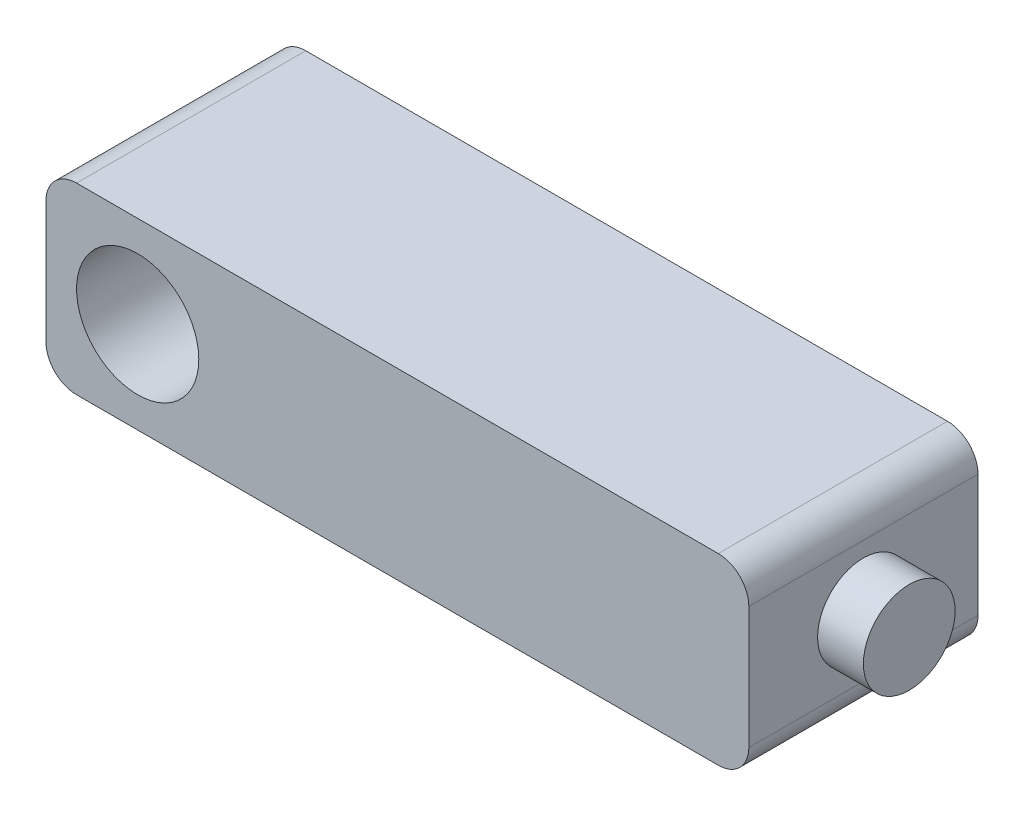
ISO-10303-21;
HEADER;
FILE_DESCRIPTION(('STEP AP214'),'2;1');
FILE_NAME('part.step','',(''),(''),'','','');
FILE_SCHEMA(('AUTOMOTIVE_DESIGN { 1 0 10303 214 1 1 1 1 }'));
ENDSEC;
DATA;
#1=APPLICATION_CONTEXT('core data for automotive mechanical design processes');
#2=APPLICATION_PROTOCOL_DEFINITION('international standard','automotive_design',2000,#1);
#3=PRODUCT_CONTEXT('',#1,'mechanical');
#4=PRODUCT('Part','Part','',(#3));
#5=PRODUCT_RELATED_PRODUCT_CATEGORY('part','',(#4));
#6=PRODUCT_DEFINITION_FORMATION('','',#4);
#7=PRODUCT_DEFINITION_CONTEXT('part definition',#1,'design');
#8=PRODUCT_DEFINITION('design','',#6,#7);
#9=PRODUCT_DEFINITION_SHAPE('','',#8);
#10=(LENGTH_UNIT() NAMED_UNIT(*) SI_UNIT(.MILLI.,.METRE.));
#11=(NAMED_UNIT(*) PLANE_ANGLE_UNIT() SI_UNIT($,.RADIAN.));
#12=(NAMED_UNIT(*) SI_UNIT($,.STERADIAN.) SOLID_ANGLE_UNIT());
#13=UNCERTAINTY_MEASURE_WITH_UNIT(LENGTH_MEASURE(1.E-05),#10,'distance_accuracy_value','');
#14=(GEOMETRIC_REPRESENTATION_CONTEXT(3) GLOBAL_UNCERTAINTY_ASSIGNED_CONTEXT((#13)) GLOBAL_UNIT_ASSIGNED_CONTEXT((#10,
#11,#12)) REPRESENTATION_CONTEXT('',''));
#15=CARTESIAN_POINT('',(0.,0.,0.));
#16=DIRECTION('',(0.,0.,1.));
#17=DIRECTION('',(1.,0.,0.));
#18=AXIS2_PLACEMENT_3D('',#15,#16,#17);
#19=CARTESIAN_POINT('',(460.,0.,150.));
#20=DIRECTION('',(-1.,0.,0.));
#21=DIRECTION('',(0.,0.,1.));
#22=AXIS2_PLACEMENT_3D('',#19,#20,#21);
#23=PLANE('',#22);
#24=DIRECTION('',(0.,1.,0.));
#25=VECTOR('',#24,1.);
#26=CARTESIAN_POINT('',(460.,0.,150.));
#27=LINE('',#26,#25);
#28=CARTESIAN_POINT('',(460.,20.,150.));
#29=VERTEX_POINT('',#28);
#30=CARTESIAN_POINT('',(460.,100.,150.));
#31=VERTEX_POINT('',#30);
#32=EDGE_CURVE('E164',#29,#31,#27,.T.);
#33=ORIENTED_EDGE('',*,*,#32,.F.);
#34=DIRECTION('',(0.,0.,-1.));
#35=VECTOR('',#34,1.);
#36=CARTESIAN_POINT('',(460.,20.,150.));
#37=LINE('',#36,#35);
#38=CARTESIAN_POINT('',(460.,20.,0.));
#39=VERTEX_POINT('',#38);
#40=EDGE_CURVE('E11',#29,#39,#37,.T.);
#41=ORIENTED_EDGE('',*,*,#40,.T.);
#42=DIRECTION('',(0.,1.,0.));
#43=VECTOR('',#42,1.);
#44=CARTESIAN_POINT('',(460.,0.,0.));
#45=LINE('',#44,#43);
#46=CARTESIAN_POINT('',(460.,100.,0.));
#47=VERTEX_POINT('',#46);
#48=EDGE_CURVE('E127',#39,#47,#45,.T.);
#49=ORIENTED_EDGE('',*,*,#48,.T.);
#50=DIRECTION('',(0.,0.,-1.));
#51=VECTOR('',#50,1.);
#52=CARTESIAN_POINT('',(460.,100.,150.));
#53=LINE('',#52,#51);
#54=EDGE_CURVE('E41',#47,#31,#53,.F.);
#55=ORIENTED_EDGE('',*,*,#54,.T.);
#56=EDGE_LOOP('',(#33,#41,#49,#55));
#57=FACE_BOUND('',#56,.T.);
#58=CARTESIAN_POINT('',(460.,60.,75.));
#59=DIRECTION('',(-1.,0.,0.));
#60=DIRECTION('',(0.,0.,1.));
#61=AXIS2_PLACEMENT_3D('',#58,#59,#60);
#62=CIRCLE('',#61,30.);
#63=CARTESIAN_POINT('',(460.,60.,105.));
#64=VERTEX_POINT('',#63);
#65=EDGE_CURVE('E139',#64,#64,#62,.F.);
#66=ORIENTED_EDGE('',*,*,#65,.F.);
#67=EDGE_LOOP('',(#66));
#68=FACE_BOUND('',#67,.T.);
#69=ADVANCED_FACE('F33',(#57,#68),#23,.F.);
#70=CARTESIAN_POINT('',(0.,0.,150.));
#71=DIRECTION('',(1.,0.,0.));
#72=DIRECTION('',(0.,0.,-1.));
#73=AXIS2_PLACEMENT_3D('',#70,#71,#72);
#74=PLANE('',#73);
#75=DIRECTION('',(0.,-1.,0.));
#76=VECTOR('',#75,1.);
#77=CARTESIAN_POINT('',(0.,0.,0.));
#78=LINE('',#77,#76);
#79=CARTESIAN_POINT('',(0.,100.,0.));
#80=VERTEX_POINT('',#79);
#81=CARTESIAN_POINT('',(0.,20.,0.));
#82=VERTEX_POINT('',#81);
#83=EDGE_CURVE('E128',#80,#82,#78,.T.);
#84=ORIENTED_EDGE('',*,*,#83,.T.);
#85=DIRECTION('',(0.,0.,-1.));
#86=VECTOR('',#85,1.);
#87=CARTESIAN_POINT('',(0.,20.,150.));
#88=LINE('',#87,#86);
#89=CARTESIAN_POINT('',(0.,20.,150.));
#90=VERTEX_POINT('',#89);
#91=EDGE_CURVE('E105',#82,#90,#88,.F.);
#92=ORIENTED_EDGE('',*,*,#91,.T.);
#93=DIRECTION('',(0.,-1.,0.));
#94=VECTOR('',#93,1.);
#95=CARTESIAN_POINT('',(0.,0.,150.));
#96=LINE('',#95,#94);
#97=CARTESIAN_POINT('',(0.,100.,150.));
#98=VERTEX_POINT('',#97);
#99=EDGE_CURVE('E138',#98,#90,#96,.T.);
#100=ORIENTED_EDGE('',*,*,#99,.F.);
#101=DIRECTION('',(0.,0.,-1.));
#102=VECTOR('',#101,1.);
#103=CARTESIAN_POINT('',(0.,100.,150.));
#104=LINE('',#103,#102);
#105=EDGE_CURVE('E110',#98,#80,#104,.T.);
#106=ORIENTED_EDGE('',*,*,#105,.T.);
#107=EDGE_LOOP('',(#84,#92,#100,#106));
#108=FACE_BOUND('',#107,.T.);
#109=ADVANCED_FACE('F180',(#108),#74,.F.);
#110=CARTESIAN_POINT('',(0.,0.,150.));
#111=DIRECTION('',(0.,1.,0.));
#112=DIRECTION('',(0.,0.,1.));
#113=AXIS2_PLACEMENT_3D('',#110,#111,#112);
#114=PLANE('',#113);
#115=DIRECTION('',(1.,0.,0.));
#116=VECTOR('',#115,1.);
#117=CARTESIAN_POINT('',(0.,0.,150.));
#118=LINE('',#117,#116);
#119=CARTESIAN_POINT('',(20.,0.,150.));
#120=VERTEX_POINT('',#119);
#121=CARTESIAN_POINT('',(440.,0.,150.));
#122=VERTEX_POINT('',#121);
#123=EDGE_CURVE('E120',#120,#122,#118,.T.);
#124=ORIENTED_EDGE('',*,*,#123,.F.);
#125=DIRECTION('',(0.,0.,-1.));
#126=VECTOR('',#125,1.);
#127=CARTESIAN_POINT('',(20.,0.,150.));
#128=LINE('',#127,#126);
#129=CARTESIAN_POINT('',(20.,0.,0.));
#130=VERTEX_POINT('',#129);
#131=EDGE_CURVE('E104',#120,#130,#128,.T.);
#132=ORIENTED_EDGE('',*,*,#131,.T.);
#133=DIRECTION('',(1.,0.,0.));
#134=VECTOR('',#133,1.);
#135=CARTESIAN_POINT('',(0.,0.,0.));
#136=LINE('',#135,#134);
#137=CARTESIAN_POINT('',(440.,0.,0.));
#138=VERTEX_POINT('',#137);
#139=EDGE_CURVE('E117',#130,#138,#136,.T.);
#140=ORIENTED_EDGE('',*,*,#139,.T.);
#141=DIRECTION('',(0.,0.,-1.));
#142=VECTOR('',#141,1.);
#143=CARTESIAN_POINT('',(440.,0.,150.));
#144=LINE('',#143,#142);
#145=EDGE_CURVE('E122',#138,#122,#144,.F.);
#146=ORIENTED_EDGE('',*,*,#145,.T.);
#147=EDGE_LOOP('',(#124,#132,#140,#146));
#148=FACE_BOUND('',#147,.T.);
#149=ADVANCED_FACE('F116',(#148),#114,.F.);
#150=CARTESIAN_POINT('',(0.,120.,150.));
#151=DIRECTION('',(0.,-1.,0.));
#152=DIRECTION('',(0.,0.,-1.));
#153=AXIS2_PLACEMENT_3D('',#150,#151,#152);
#154=PLANE('',#153);
#155=DIRECTION('',(-1.,0.,0.));
#156=VECTOR('',#155,1.);
#157=CARTESIAN_POINT('',(0.,120.,0.));
#158=LINE('',#157,#156);
#159=CARTESIAN_POINT('',(440.,120.,0.));
#160=VERTEX_POINT('',#159);
#161=CARTESIAN_POINT('',(20.,120.,0.));
#162=VERTEX_POINT('',#161);
#163=EDGE_CURVE('E131',#160,#162,#158,.T.);
#164=ORIENTED_EDGE('',*,*,#163,.T.);
#165=DIRECTION('',(0.,0.,-1.));
#166=VECTOR('',#165,1.);
#167=CARTESIAN_POINT('',(20.,120.,150.));
#168=LINE('',#167,#166);
#169=CARTESIAN_POINT('',(20.,120.,150.));
#170=VERTEX_POINT('',#169);
#171=EDGE_CURVE('E48',#162,#170,#168,.F.);
#172=ORIENTED_EDGE('',*,*,#171,.T.);
#173=DIRECTION('',(-1.,0.,0.));
#174=VECTOR('',#173,1.);
#175=CARTESIAN_POINT('',(0.,120.,150.));
#176=LINE('',#175,#174);
#177=CARTESIAN_POINT('',(440.,120.,150.));
#178=VERTEX_POINT('',#177);
#179=EDGE_CURVE('E142',#178,#170,#176,.T.);
#180=ORIENTED_EDGE('',*,*,#179,.F.);
#181=DIRECTION('',(0.,0.,-1.));
#182=VECTOR('',#181,1.);
#183=CARTESIAN_POINT('',(440.,120.,150.));
#184=LINE('',#183,#182);
#185=EDGE_CURVE('E157',#178,#160,#184,.T.);
#186=ORIENTED_EDGE('',*,*,#185,.T.);
#187=EDGE_LOOP('',(#164,#172,#180,#186));
#188=FACE_BOUND('',#187,.T.);
#189=ADVANCED_FACE('F173',(#188),#154,.F.);
#190=CARTESIAN_POINT('',(0.,120.,150.));
#191=DIRECTION('',(0.,0.,-1.));
#192=DIRECTION('',(-1.,0.,0.));
#193=AXIS2_PLACEMENT_3D('',#190,#191,#192);
#194=PLANE('',#193);
#195=CARTESIAN_POINT('',(60.,60.,150.));
#196=DIRECTION('',(0.,0.,1.));
#197=DIRECTION('',(1.,0.,0.));
#198=AXIS2_PLACEMENT_3D('',#195,#196,#197);
#199=CIRCLE('',#198,40.);
#200=CARTESIAN_POINT('',(100.,60.,150.));
#201=VERTEX_POINT('',#200);
#202=EDGE_CURVE('E184',#201,#201,#199,.T.);
#203=ORIENTED_EDGE('',*,*,#202,.F.);
#204=EDGE_LOOP('',(#203));
#205=FACE_BOUND('',#204,.T.);
#206=ORIENTED_EDGE('',*,*,#99,.T.);
#207=CARTESIAN_POINT('',(20.,20.,150.));
#208=DIRECTION('',(0.,0.,-1.));
#209=DIRECTION('',(-1.,0.,0.));
#210=AXIS2_PLACEMENT_3D('',#207,#208,#209);
#211=CIRCLE('',#210,20.);
#212=EDGE_CURVE('E155',#90,#120,#211,.F.);
#213=ORIENTED_EDGE('',*,*,#212,.T.);
#214=ORIENTED_EDGE('',*,*,#123,.T.);
#215=CARTESIAN_POINT('',(440.,20.,150.));
#216=DIRECTION('',(0.,0.,-1.));
#217=DIRECTION('',(-1.,0.,0.));
#218=AXIS2_PLACEMENT_3D('',#215,#216,#217);
#219=CIRCLE('',#218,20.);
#220=EDGE_CURVE('E151',#122,#29,#219,.F.);
#221=ORIENTED_EDGE('',*,*,#220,.T.);
#222=ORIENTED_EDGE('',*,*,#32,.T.);
#223=CARTESIAN_POINT('',(440.,100.,150.));
#224=DIRECTION('',(0.,0.,-1.));
#225=DIRECTION('',(-1.,0.,0.));
#226=AXIS2_PLACEMENT_3D('',#223,#224,#225);
#227=CIRCLE('',#226,20.);
#228=EDGE_CURVE('E55',#31,#178,#227,.F.);
#229=ORIENTED_EDGE('',*,*,#228,.T.);
#230=ORIENTED_EDGE('',*,*,#179,.T.);
#231=CARTESIAN_POINT('',(20.,100.,150.));
#232=DIRECTION('',(0.,0.,-1.));
#233=DIRECTION('',(-1.,0.,0.));
#234=AXIS2_PLACEMENT_3D('',#231,#232,#233);
#235=CIRCLE('',#234,20.);
#236=EDGE_CURVE('E153',#170,#98,#235,.F.);
#237=ORIENTED_EDGE('',*,*,#236,.T.);
#238=EDGE_LOOP('',(#206,#213,#214,#221,#222,#229,#230,#237));
#239=FACE_BOUND('',#238,.T.);
#240=ADVANCED_FACE('F168',(#205,#239),#194,.F.);
#241=CARTESIAN_POINT('',(0.,120.,0.));
#242=DIRECTION('',(0.,0.,-1.));
#243=DIRECTION('',(-1.,0.,0.));
#244=AXIS2_PLACEMENT_3D('',#241,#242,#243);
#245=PLANE('',#244);
#246=CARTESIAN_POINT('',(60.,60.,0.));
#247=DIRECTION('',(0.,0.,1.));
#248=DIRECTION('',(1.,0.,0.));
#249=AXIS2_PLACEMENT_3D('',#246,#247,#248);
#250=CIRCLE('',#249,40.);
#251=CARTESIAN_POINT('',(100.,60.,0.));
#252=VERTEX_POINT('',#251);
#253=EDGE_CURVE('E133',#252,#252,#250,.T.);
#254=ORIENTED_EDGE('',*,*,#253,.T.);
#255=EDGE_LOOP('',(#254));
#256=FACE_BOUND('',#255,.T.);
#257=ORIENTED_EDGE('',*,*,#139,.F.);
#258=CARTESIAN_POINT('',(20.,20.,0.));
#259=DIRECTION('',(0.,0.,-1.));
#260=DIRECTION('',(-1.,0.,0.));
#261=AXIS2_PLACEMENT_3D('',#258,#259,#260);
#262=CIRCLE('',#261,20.);
#263=EDGE_CURVE('E100',#130,#82,#262,.T.);
#264=ORIENTED_EDGE('',*,*,#263,.T.);
#265=ORIENTED_EDGE('',*,*,#83,.F.);
#266=CARTESIAN_POINT('',(20.,100.,0.));
#267=DIRECTION('',(0.,0.,-1.));
#268=DIRECTION('',(-1.,0.,0.));
#269=AXIS2_PLACEMENT_3D('',#266,#267,#268);
#270=CIRCLE('',#269,20.);
#271=EDGE_CURVE('E111',#80,#162,#270,.T.);
#272=ORIENTED_EDGE('',*,*,#271,.T.);
#273=ORIENTED_EDGE('',*,*,#163,.F.);
#274=CARTESIAN_POINT('',(440.,100.,0.));
#275=DIRECTION('',(0.,0.,-1.));
#276=DIRECTION('',(-1.,0.,0.));
#277=AXIS2_PLACEMENT_3D('',#274,#275,#276);
#278=CIRCLE('',#277,20.);
#279=EDGE_CURVE('E121',#160,#47,#278,.T.);
#280=ORIENTED_EDGE('',*,*,#279,.T.);
#281=ORIENTED_EDGE('',*,*,#48,.F.);
#282=CARTESIAN_POINT('',(440.,20.,0.));
#283=DIRECTION('',(0.,0.,-1.));
#284=DIRECTION('',(-1.,0.,0.));
#285=AXIS2_PLACEMENT_3D('',#282,#283,#284);
#286=CIRCLE('',#285,20.);
#287=EDGE_CURVE('E126',#39,#138,#286,.T.);
#288=ORIENTED_EDGE('',*,*,#287,.T.);
#289=EDGE_LOOP('',(#257,#264,#265,#272,#273,#280,#281,#288));
#290=FACE_BOUND('',#289,.T.);
#291=ADVANCED_FACE('F124',(#256,#290),#245,.T.);
#292=CARTESIAN_POINT('',(60.,60.,0.));
#293=DIRECTION('',(0.,0.,1.));
#294=DIRECTION('',(1.,0.,0.));
#295=AXIS2_PLACEMENT_3D('',#292,#293,#294);
#296=CYLINDRICAL_SURFACE('',#295,40.);
#297=ORIENTED_EDGE('',*,*,#253,.F.);
#298=EDGE_LOOP('',(#297));
#299=FACE_BOUND('',#298,.T.);
#300=ORIENTED_EDGE('',*,*,#202,.T.);
#301=EDGE_LOOP('',(#300));
#302=FACE_BOUND('',#301,.T.);
#303=ADVANCED_FACE('F198',(#299,#302),#296,.F.);
#304=CARTESIAN_POINT('',(490.,60.,75.));
#305=DIRECTION('',(-1.,0.,0.));
#306=DIRECTION('',(0.,0.,1.));
#307=AXIS2_PLACEMENT_3D('',#304,#305,#306);
#308=CYLINDRICAL_SURFACE('',#307,30.);
#309=CARTESIAN_POINT('',(490.,60.,75.));
#310=DIRECTION('',(1.,0.,0.));
#311=DIRECTION('',(0.,0.,-1.));
#312=AXIS2_PLACEMENT_3D('',#309,#310,#311);
#313=CIRCLE('',#312,30.);
#314=CARTESIAN_POINT('',(490.,60.,45.));
#315=VERTEX_POINT('',#314);
#316=EDGE_CURVE('E187',#315,#315,#313,.T.);
#317=ORIENTED_EDGE('',*,*,#316,.F.);
#318=EDGE_LOOP('',(#317));
#319=FACE_BOUND('',#318,.T.);
#320=ORIENTED_EDGE('',*,*,#65,.T.);
#321=EDGE_LOOP('',(#320));
#322=FACE_BOUND('',#321,.T.);
#323=ADVANCED_FACE('F195',(#319,#322),#308,.T.);
#324=CARTESIAN_POINT('',(490.,60.,75.));
#325=DIRECTION('',(1.,0.,0.));
#326=DIRECTION('',(0.,0.,-1.));
#327=AXIS2_PLACEMENT_3D('',#324,#325,#326);
#328=PLANE('',#327);
#329=ORIENTED_EDGE('',*,*,#316,.T.);
#330=EDGE_LOOP('',(#329));
#331=FACE_BOUND('',#330,.T.);
#332=ADVANCED_FACE('F193',(#331),#328,.T.);
#333=CARTESIAN_POINT('',(20.,20.,150.));
#334=DIRECTION('',(0.,0.,-1.));
#335=DIRECTION('',(-1.,0.,0.));
#336=AXIS2_PLACEMENT_3D('',#333,#334,#335);
#337=CYLINDRICAL_SURFACE('',#336,20.);
#338=ORIENTED_EDGE('',*,*,#212,.F.);
#339=ORIENTED_EDGE('',*,*,#91,.F.);
#340=ORIENTED_EDGE('',*,*,#263,.F.);
#341=ORIENTED_EDGE('',*,*,#131,.F.);
#342=EDGE_LOOP('',(#338,#339,#340,#341));
#343=FACE_BOUND('',#342,.T.);
#344=ADVANCED_FACE('F103',(#343),#337,.T.);
#345=CARTESIAN_POINT('',(20.,100.,150.));
#346=DIRECTION('',(0.,0.,-1.));
#347=DIRECTION('',(-1.,0.,0.));
#348=AXIS2_PLACEMENT_3D('',#345,#346,#347);
#349=CYLINDRICAL_SURFACE('',#348,20.);
#350=ORIENTED_EDGE('',*,*,#236,.F.);
#351=ORIENTED_EDGE('',*,*,#171,.F.);
#352=ORIENTED_EDGE('',*,*,#271,.F.);
#353=ORIENTED_EDGE('',*,*,#105,.F.);
#354=EDGE_LOOP('',(#350,#351,#352,#353));
#355=FACE_BOUND('',#354,.T.);
#356=ADVANCED_FACE('F177',(#355),#349,.T.);
#357=CARTESIAN_POINT('',(440.,20.,150.));
#358=DIRECTION('',(0.,0.,-1.));
#359=DIRECTION('',(-1.,0.,0.));
#360=AXIS2_PLACEMENT_3D('',#357,#358,#359);
#361=CYLINDRICAL_SURFACE('',#360,20.);
#362=ORIENTED_EDGE('',*,*,#220,.F.);
#363=ORIENTED_EDGE('',*,*,#145,.F.);
#364=ORIENTED_EDGE('',*,*,#287,.F.);
#365=ORIENTED_EDGE('',*,*,#40,.F.);
#366=EDGE_LOOP('',(#362,#363,#364,#365));
#367=FACE_BOUND('',#366,.T.);
#368=ADVANCED_FACE('F215',(#367),#361,.T.);
#369=CARTESIAN_POINT('',(440.,100.,150.));
#370=DIRECTION('',(0.,0.,-1.));
#371=DIRECTION('',(-1.,0.,0.));
#372=AXIS2_PLACEMENT_3D('',#369,#370,#371);
#373=CYLINDRICAL_SURFACE('',#372,20.);
#374=ORIENTED_EDGE('',*,*,#228,.F.);
#375=ORIENTED_EDGE('',*,*,#54,.F.);
#376=ORIENTED_EDGE('',*,*,#279,.F.);
#377=ORIENTED_EDGE('',*,*,#185,.F.);
#378=EDGE_LOOP('',(#374,#375,#376,#377));
#379=FACE_BOUND('',#378,.T.);
#380=ADVANCED_FACE('F35',(#379),#373,.T.);
#381=CLOSED_SHELL('',(#69,#109,#149,#189,#240,#291,#303,#323,#332,#344,#356,#368,#380));
#382=MANIFOLD_SOLID_BREP('B2',#381);
#383=ADVANCED_BREP_SHAPE_REPRESENTATION('',(#18,#382),#14);
#384=SHAPE_DEFINITION_REPRESENTATION(#9,#383);
ENDSEC;
END-ISO-10303-21;
